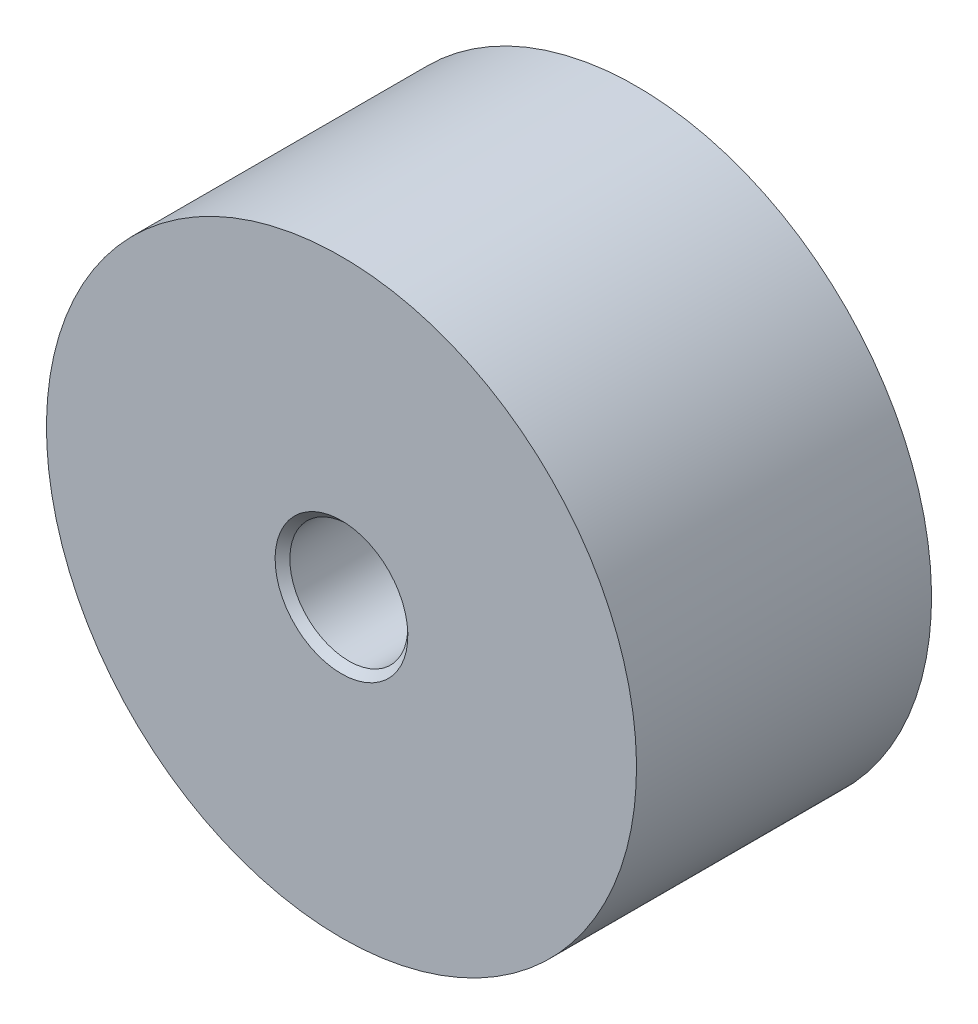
ISO-10303-21;
HEADER;
FILE_DESCRIPTION(('STEP AP214'),'2;1');
FILE_NAME('part.step','',(''),(''),'','','');
FILE_SCHEMA(('AUTOMOTIVE_DESIGN { 1 0 10303 214 1 1 1 1 }'));
ENDSEC;
DATA;
#1=APPLICATION_CONTEXT('core data for automotive mechanical design processes');
#2=APPLICATION_PROTOCOL_DEFINITION('international standard','automotive_design',2000,#1);
#3=PRODUCT_CONTEXT('',#1,'mechanical');
#4=PRODUCT('Part','Part','',(#3));
#5=PRODUCT_RELATED_PRODUCT_CATEGORY('part','',(#4));
#6=PRODUCT_DEFINITION_FORMATION('','',#4);
#7=PRODUCT_DEFINITION_CONTEXT('part definition',#1,'design');
#8=PRODUCT_DEFINITION('design','',#6,#7);
#9=PRODUCT_DEFINITION_SHAPE('','',#8);
#10=(LENGTH_UNIT() NAMED_UNIT(*) SI_UNIT(.MILLI.,.METRE.));
#11=(NAMED_UNIT(*) PLANE_ANGLE_UNIT() SI_UNIT($,.RADIAN.));
#12=(NAMED_UNIT(*) SI_UNIT($,.STERADIAN.) SOLID_ANGLE_UNIT());
#13=UNCERTAINTY_MEASURE_WITH_UNIT(LENGTH_MEASURE(1.E-05),#10,'distance_accuracy_value','');
#14=(GEOMETRIC_REPRESENTATION_CONTEXT(3) GLOBAL_UNCERTAINTY_ASSIGNED_CONTEXT((#13)) GLOBAL_UNIT_ASSIGNED_CONTEXT((#10,
#11,#12)) REPRESENTATION_CONTEXT('',''));
#15=CARTESIAN_POINT('',(0.,0.,0.));
#16=DIRECTION('',(0.,0.,1.));
#17=DIRECTION('',(1.,0.,0.));
#18=AXIS2_PLACEMENT_3D('',#15,#16,#17);
#19=CARTESIAN_POINT('',(18.666666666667,0.,20.));
#20=DIRECTION('',(0.,0.,1.));
#21=DIRECTION('',(0.,-1.,0.));
#22=AXIS2_PLACEMENT_3D('',#19,#20,#21);
#23=PLANE('',#22);
#24=CARTESIAN_POINT('',(0.,0.,20.));
#25=DIRECTION('',(0.,0.,1.));
#26=DIRECTION('',(0.,-1.,0.));
#27=AXIS2_PLACEMENT_3D('',#24,#25,#26);
#28=CIRCLE('',#27,4.5);
#29=CARTESIAN_POINT('',(0.,-4.5,20.));
#30=VERTEX_POINT('',#29);
#31=EDGE_CURVE('E8',#30,#30,#28,.F.);
#32=ORIENTED_EDGE('',*,*,#31,.T.);
#33=EDGE_LOOP('',(#32));
#34=FACE_BOUND('',#33,.T.);
#35=CARTESIAN_POINT('',(0.,0.,20.));
#36=DIRECTION('',(0.,0.,1.));
#37=DIRECTION('',(0.,-1.,0.));
#38=AXIS2_PLACEMENT_3D('',#35,#36,#37);
#39=CIRCLE('',#38,20.);
#40=CARTESIAN_POINT('',(0.,-20.,20.));
#41=VERTEX_POINT('',#40);
#42=EDGE_CURVE('E23',#41,#41,#39,.T.);
#43=ORIENTED_EDGE('',*,*,#42,.T.);
#44=EDGE_LOOP('',(#43));
#45=FACE_BOUND('',#44,.T.);
#46=ADVANCED_FACE('F12',(#34,#45),#23,.T.);
#47=CARTESIAN_POINT('',(0.,0.,0.));
#48=DIRECTION('',(0.,0.,1.));
#49=DIRECTION('',(0.,-1.,0.));
#50=AXIS2_PLACEMENT_3D('',#47,#48,#49);
#51=CYLINDRICAL_SURFACE('',#50,20.);
#52=CARTESIAN_POINT('',(0.,0.,0.));
#53=DIRECTION('',(0.,0.,1.));
#54=DIRECTION('',(0.,-1.,0.));
#55=AXIS2_PLACEMENT_3D('',#52,#53,#54);
#56=CIRCLE('',#55,20.);
#57=CARTESIAN_POINT('',(0.,-20.,0.));
#58=VERTEX_POINT('',#57);
#59=EDGE_CURVE('E27',#58,#58,#56,.T.);
#60=ORIENTED_EDGE('',*,*,#59,.T.);
#61=EDGE_LOOP('',(#60));
#62=FACE_BOUND('',#61,.T.);
#63=ORIENTED_EDGE('',*,*,#42,.F.);
#64=EDGE_LOOP('',(#63));
#65=FACE_BOUND('',#64,.T.);
#66=ADVANCED_FACE('F48',(#62,#65),#51,.T.);
#67=CARTESIAN_POINT('',(20.,0.,0.));
#68=DIRECTION('',(0.,0.,-1.));
#69=DIRECTION('',(0.,1.,0.));
#70=AXIS2_PLACEMENT_3D('',#67,#68,#69);
#71=PLANE('',#70);
#72=ORIENTED_EDGE('',*,*,#59,.F.);
#73=EDGE_LOOP('',(#72));
#74=FACE_BOUND('',#73,.T.);
#75=ADVANCED_FACE('F40',(#74),#71,.T.);
#76=CARTESIAN_POINT('',(0.,0.,14.666666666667));
#77=DIRECTION('',(0.,0.,1.));
#78=DIRECTION('',(0.,-1.,0.));
#79=AXIS2_PLACEMENT_3D('',#76,#77,#78);
#80=CYLINDRICAL_SURFACE('',#79,4.);
#81=CARTESIAN_POINT('',(0.,0.,19.5));
#82=DIRECTION('',(0.,0.,1.));
#83=DIRECTION('',(0.,-1.,0.));
#84=AXIS2_PLACEMENT_3D('',#81,#82,#83);
#85=CIRCLE('',#84,4.);
#86=CARTESIAN_POINT('',(0.,-4.,19.5));
#87=VERTEX_POINT('',#86);
#88=EDGE_CURVE('E19',#87,#87,#85,.T.);
#89=ORIENTED_EDGE('',*,*,#88,.T.);
#90=EDGE_LOOP('',(#89));
#91=FACE_BOUND('',#90,.T.);
#92=CARTESIAN_POINT('',(0.,0.,12.));
#93=DIRECTION('',(0.,0.,1.));
#94=DIRECTION('',(0.,-1.,0.));
#95=AXIS2_PLACEMENT_3D('',#92,#93,#94);
#96=CIRCLE('',#95,4.);
#97=CARTESIAN_POINT('',(0.,-4.,12.));
#98=VERTEX_POINT('',#97);
#99=EDGE_CURVE('E32',#98,#98,#96,.T.);
#100=ORIENTED_EDGE('',*,*,#99,.F.);
#101=EDGE_LOOP('',(#100));
#102=FACE_BOUND('',#101,.T.);
#103=ADVANCED_FACE('F38',(#91,#102),#80,.F.);
#104=CARTESIAN_POINT('',(0.,0.,12.));
#105=DIRECTION('',(0.,0.,1.));
#106=DIRECTION('',(0.,-1.,0.));
#107=AXIS2_PLACEMENT_3D('',#104,#105,#106);
#108=PLANE('',#107);
#109=ORIENTED_EDGE('',*,*,#99,.T.);
#110=EDGE_LOOP('',(#109));
#111=FACE_BOUND('',#110,.T.);
#112=ADVANCED_FACE('F36',(#111),#108,.T.);
#113=CARTESIAN_POINT('',(0.,0.,19.5));
#114=DIRECTION('',(0.,0.,1.));
#115=DIRECTION('',(0.,-1.,0.));
#116=AXIS2_PLACEMENT_3D('',#113,#114,#115);
#117=CONICAL_SURFACE('',#116,4.,0.785398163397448);
#118=ORIENTED_EDGE('',*,*,#31,.F.);
#119=EDGE_LOOP('',(#118));
#120=FACE_BOUND('',#119,.T.);
#121=ORIENTED_EDGE('',*,*,#88,.F.);
#122=EDGE_LOOP('',(#121));
#123=FACE_BOUND('',#122,.T.);
#124=ADVANCED_FACE('F14',(#120,#123),#117,.F.);
#125=CLOSED_SHELL('',(#46,#66,#75,#103,#112,#124));
#126=MANIFOLD_SOLID_BREP('B1',#125);
#127=ADVANCED_BREP_SHAPE_REPRESENTATION('',(#18,#126),#14);
#128=SHAPE_DEFINITION_REPRESENTATION(#9,#127);
ENDSEC;
END-ISO-10303-21;
